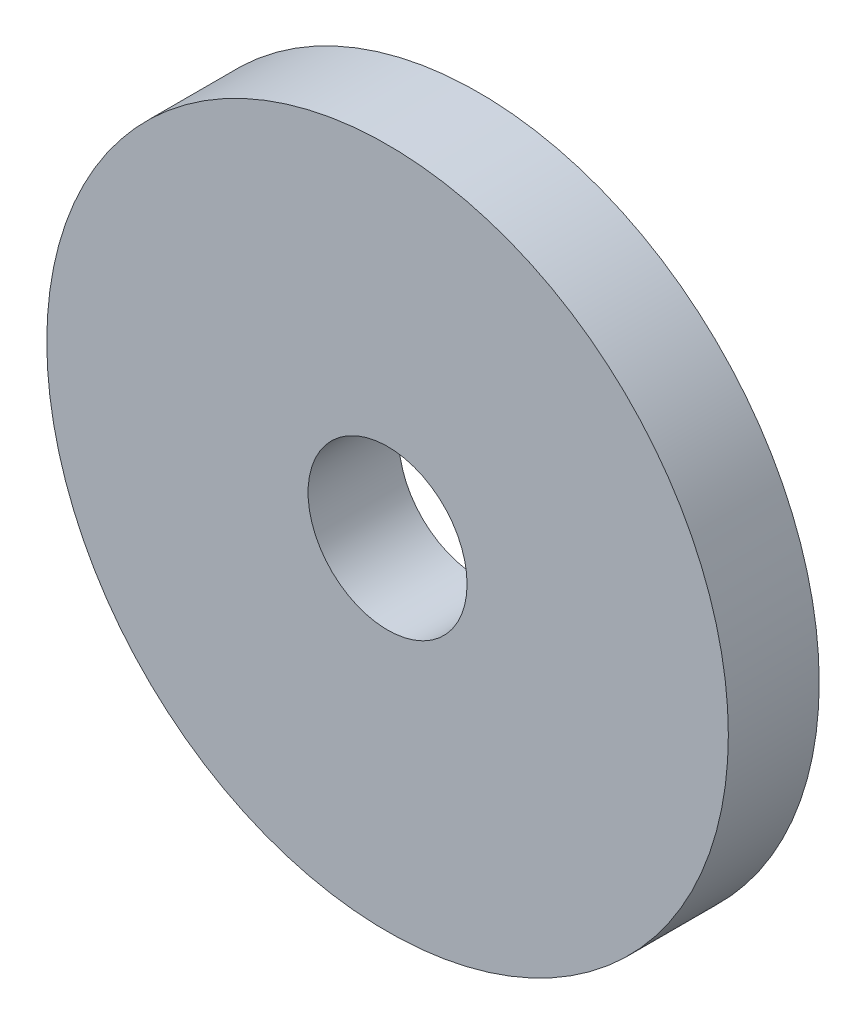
from build123d import *

# Parameters (mm, degrees)
ESBO_O1_R                = 7.5
ESBO_O1_R_2              = 1.75
RESSALTO_EXTRUS_O1_DEPTH = 2


with BuildPart() as part:
    # Esbo_o1 → Ressalto-extrus_o1 (new body)
    with BuildSketch(Plane.XY):
        Circle(ESBO_O1_R)
        Circle(ESBO_O1_R_2, mode=Mode.SUBTRACT)
    extrude(amount=RESSALTO_EXTRUS_O1_DEPTH)


solid = part.part
